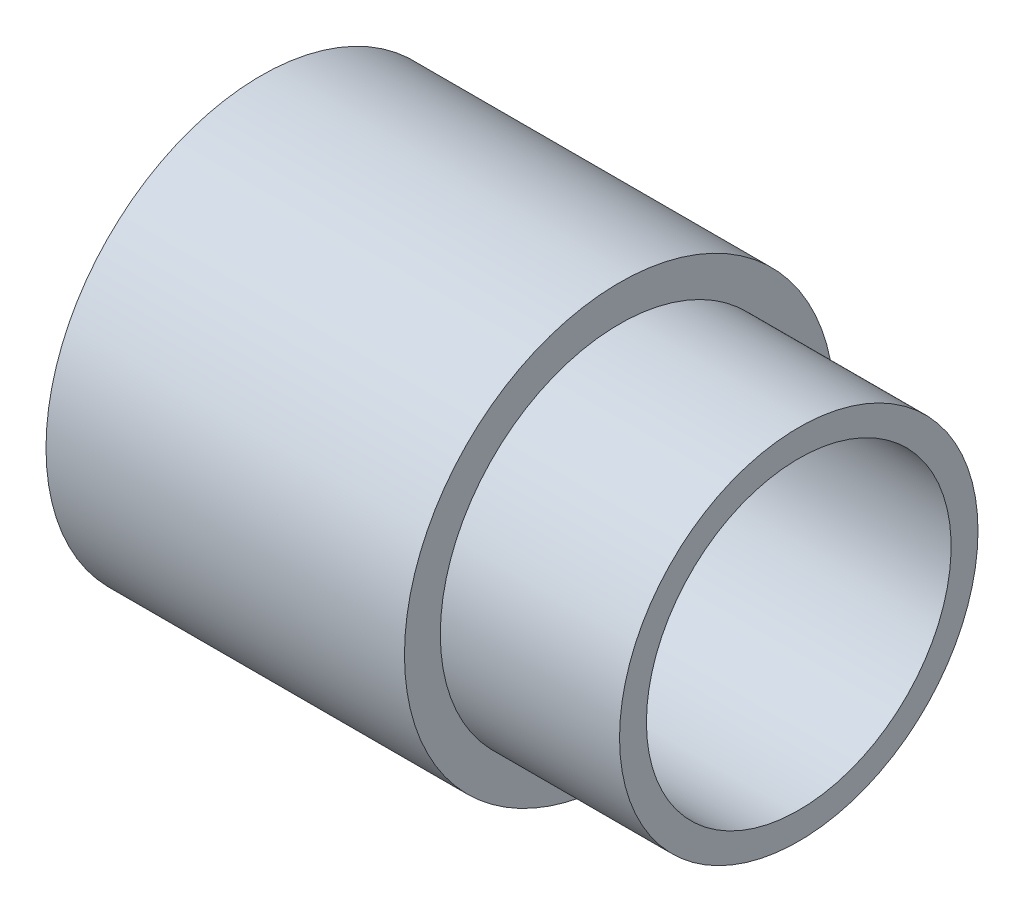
ISO-10303-21;
HEADER;
FILE_DESCRIPTION(('STEP AP214'),'2;1');
FILE_NAME('part.step','',(''),(''),'','','');
FILE_SCHEMA(('AUTOMOTIVE_DESIGN { 1 0 10303 214 1 1 1 1 }'));
ENDSEC;
DATA;
#1=APPLICATION_CONTEXT('core data for automotive mechanical design processes');
#2=APPLICATION_PROTOCOL_DEFINITION('international standard','automotive_design',2000,#1);
#3=PRODUCT_CONTEXT('',#1,'mechanical');
#4=PRODUCT('Part','Part','',(#3));
#5=PRODUCT_RELATED_PRODUCT_CATEGORY('part','',(#4));
#6=PRODUCT_DEFINITION_FORMATION('','',#4);
#7=PRODUCT_DEFINITION_CONTEXT('part definition',#1,'design');
#8=PRODUCT_DEFINITION('design','',#6,#7);
#9=PRODUCT_DEFINITION_SHAPE('','',#8);
#10=(LENGTH_UNIT() NAMED_UNIT(*) SI_UNIT(.MILLI.,.METRE.));
#11=(NAMED_UNIT(*) PLANE_ANGLE_UNIT() SI_UNIT($,.RADIAN.));
#12=(NAMED_UNIT(*) SI_UNIT($,.STERADIAN.) SOLID_ANGLE_UNIT());
#13=UNCERTAINTY_MEASURE_WITH_UNIT(LENGTH_MEASURE(1.E-05),#10,'distance_accuracy_value','');
#14=(GEOMETRIC_REPRESENTATION_CONTEXT(3) GLOBAL_UNCERTAINTY_ASSIGNED_CONTEXT((#13)) GLOBAL_UNIT_ASSIGNED_CONTEXT((#10,
#11,#12)) REPRESENTATION_CONTEXT('',''));
#15=CARTESIAN_POINT('',(0.,0.,0.));
#16=DIRECTION('',(0.,0.,1.));
#17=DIRECTION('',(1.,0.,0.));
#18=AXIS2_PLACEMENT_3D('',#15,#16,#17);
#19=CARTESIAN_POINT('',(0.,6.,0.));
#20=DIRECTION('',(1.,0.,0.));
#21=DIRECTION('',(0.,0.,-1.));
#22=AXIS2_PLACEMENT_3D('',#19,#20,#21);
#23=PLANE('',#22);
#24=CARTESIAN_POINT('',(0.,0.,0.));
#25=DIRECTION('',(-1.,0.,0.));
#26=DIRECTION('',(0.,0.,1.));
#27=AXIS2_PLACEMENT_3D('',#24,#25,#26);
#28=CIRCLE('',#27,4.25);
#29=CARTESIAN_POINT('',(0.,0.,4.25));
#30=VERTEX_POINT('',#29);
#31=EDGE_CURVE('E10',#30,#30,#28,.T.);
#32=ORIENTED_EDGE('',*,*,#31,.F.);
#33=EDGE_LOOP('',(#32));
#34=FACE_BOUND('',#33,.T.);
#35=CARTESIAN_POINT('',(0.,0.,0.));
#36=DIRECTION('',(-1.,0.,0.));
#37=DIRECTION('',(0.,0.,1.));
#38=AXIS2_PLACEMENT_3D('',#35,#36,#37);
#39=CIRCLE('',#38,6.);
#40=CARTESIAN_POINT('',(0.,0.,6.));
#41=VERTEX_POINT('',#40);
#42=EDGE_CURVE('E51',#41,#41,#39,.T.);
#43=ORIENTED_EDGE('',*,*,#42,.T.);
#44=EDGE_LOOP('',(#43));
#45=FACE_BOUND('',#44,.T.);
#46=ADVANCED_FACE('F29',(#34,#45),#23,.F.);
#47=CARTESIAN_POINT('',(0.,0.,0.));
#48=DIRECTION('',(-1.,0.,0.));
#49=DIRECTION('',(0.,0.,1.));
#50=AXIS2_PLACEMENT_3D('',#47,#48,#49);
#51=CYLINDRICAL_SURFACE('',#50,4.25);
#52=CARTESIAN_POINT('',(15.,0.,0.));
#53=DIRECTION('',(-1.,0.,0.));
#54=DIRECTION('',(0.,0.,1.));
#55=AXIS2_PLACEMENT_3D('',#52,#53,#54);
#56=CIRCLE('',#55,4.25);
#57=CARTESIAN_POINT('',(15.,0.,4.25));
#58=VERTEX_POINT('',#57);
#59=EDGE_CURVE('E35',#58,#58,#56,.T.);
#60=ORIENTED_EDGE('',*,*,#59,.F.);
#61=EDGE_LOOP('',(#60));
#62=FACE_BOUND('',#61,.T.);
#63=ORIENTED_EDGE('',*,*,#31,.T.);
#64=EDGE_LOOP('',(#63));
#65=FACE_BOUND('',#64,.T.);
#66=ADVANCED_FACE('F76',(#62,#65),#51,.F.);
#67=CARTESIAN_POINT('',(15.,4.25,0.));
#68=DIRECTION('',(-1.,0.,0.));
#69=DIRECTION('',(0.,0.,1.));
#70=AXIS2_PLACEMENT_3D('',#67,#68,#69);
#71=PLANE('',#70);
#72=CARTESIAN_POINT('',(15.,0.,0.));
#73=DIRECTION('',(-1.,0.,0.));
#74=DIRECTION('',(0.,0.,1.));
#75=AXIS2_PLACEMENT_3D('',#72,#73,#74);
#76=CIRCLE('',#75,5.);
#77=CARTESIAN_POINT('',(15.,0.,5.));
#78=VERTEX_POINT('',#77);
#79=EDGE_CURVE('E39',#78,#78,#76,.T.);
#80=ORIENTED_EDGE('',*,*,#79,.F.);
#81=EDGE_LOOP('',(#80));
#82=FACE_BOUND('',#81,.T.);
#83=ORIENTED_EDGE('',*,*,#59,.T.);
#84=EDGE_LOOP('',(#83));
#85=FACE_BOUND('',#84,.T.);
#86=ADVANCED_FACE('F71',(#82,#85),#71,.F.);
#87=CARTESIAN_POINT('',(0.,0.,0.));
#88=DIRECTION('',(-1.,0.,0.));
#89=DIRECTION('',(0.,0.,1.));
#90=AXIS2_PLACEMENT_3D('',#87,#88,#89);
#91=CYLINDRICAL_SURFACE('',#90,5.);
#92=CARTESIAN_POINT('',(10.,0.,0.));
#93=DIRECTION('',(-1.,0.,0.));
#94=DIRECTION('',(0.,0.,1.));
#95=AXIS2_PLACEMENT_3D('',#92,#93,#94);
#96=CIRCLE('',#95,5.);
#97=CARTESIAN_POINT('',(10.,0.,5.));
#98=VERTEX_POINT('',#97);
#99=EDGE_CURVE('E43',#98,#98,#96,.T.);
#100=ORIENTED_EDGE('',*,*,#99,.F.);
#101=EDGE_LOOP('',(#100));
#102=FACE_BOUND('',#101,.T.);
#103=ORIENTED_EDGE('',*,*,#79,.T.);
#104=EDGE_LOOP('',(#103));
#105=FACE_BOUND('',#104,.T.);
#106=ADVANCED_FACE('F65',(#102,#105),#91,.T.);
#107=CARTESIAN_POINT('',(10.,5.,0.));
#108=DIRECTION('',(-1.,0.,0.));
#109=DIRECTION('',(0.,0.,1.));
#110=AXIS2_PLACEMENT_3D('',#107,#108,#109);
#111=PLANE('',#110);
#112=CARTESIAN_POINT('',(10.,0.,0.));
#113=DIRECTION('',(-1.,0.,0.));
#114=DIRECTION('',(0.,0.,1.));
#115=AXIS2_PLACEMENT_3D('',#112,#113,#114);
#116=CIRCLE('',#115,6.);
#117=CARTESIAN_POINT('',(10.,0.,6.));
#118=VERTEX_POINT('',#117);
#119=EDGE_CURVE('E48',#118,#118,#116,.T.);
#120=ORIENTED_EDGE('',*,*,#119,.F.);
#121=EDGE_LOOP('',(#120));
#122=FACE_BOUND('',#121,.T.);
#123=ORIENTED_EDGE('',*,*,#99,.T.);
#124=EDGE_LOOP('',(#123));
#125=FACE_BOUND('',#124,.T.);
#126=ADVANCED_FACE('F59',(#122,#125),#111,.F.);
#127=CARTESIAN_POINT('',(0.,0.,0.));
#128=DIRECTION('',(-1.,0.,0.));
#129=DIRECTION('',(0.,0.,1.));
#130=AXIS2_PLACEMENT_3D('',#127,#128,#129);
#131=CYLINDRICAL_SURFACE('',#130,6.);
#132=ORIENTED_EDGE('',*,*,#42,.F.);
#133=EDGE_LOOP('',(#132));
#134=FACE_BOUND('',#133,.T.);
#135=ORIENTED_EDGE('',*,*,#119,.T.);
#136=EDGE_LOOP('',(#135));
#137=FACE_BOUND('',#136,.T.);
#138=ADVANCED_FACE('F56',(#134,#137),#131,.T.);
#139=CLOSED_SHELL('',(#46,#66,#86,#106,#126,#138));
#140=MANIFOLD_SOLID_BREP('B2',#139);
#141=ADVANCED_BREP_SHAPE_REPRESENTATION('',(#18,#140),#14);
#142=SHAPE_DEFINITION_REPRESENTATION(#9,#141);
ENDSEC;
END-ISO-10303-21;
